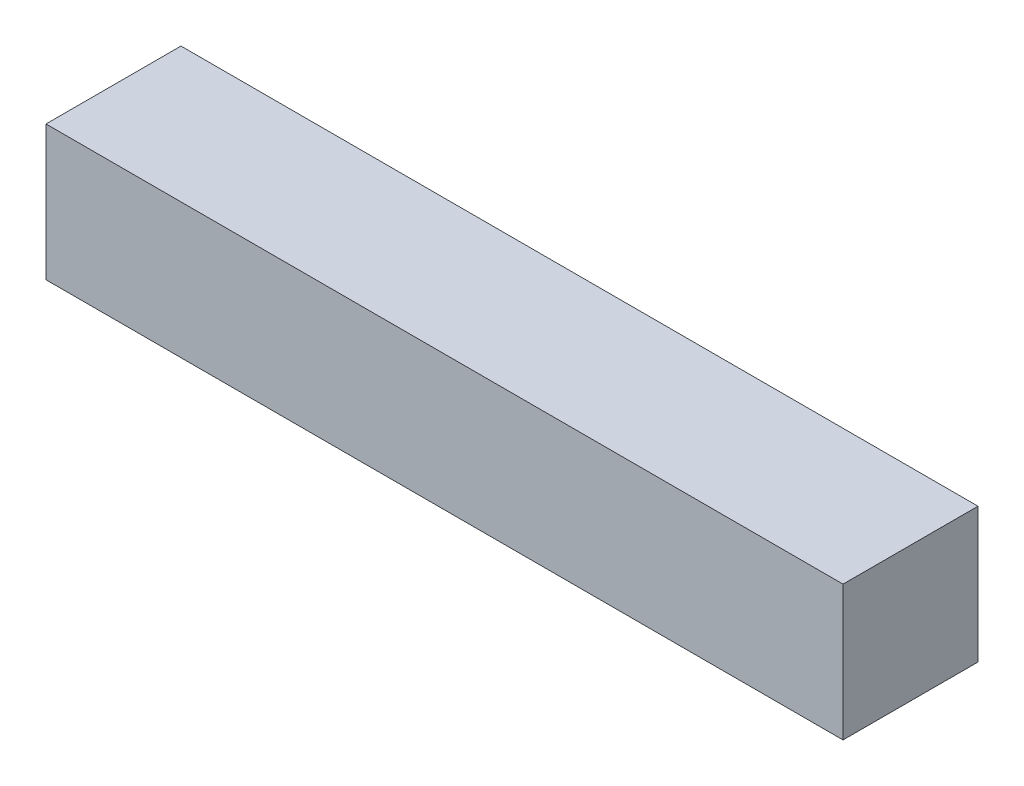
ISO-10303-21;
HEADER;
FILE_DESCRIPTION(('STEP AP214'),'2;1');
FILE_NAME('part.step','',(''),(''),'','','');
FILE_SCHEMA(('AUTOMOTIVE_DESIGN { 1 0 10303 214 1 1 1 1 }'));
ENDSEC;
DATA;
#1=APPLICATION_CONTEXT('core data for automotive mechanical design processes');
#2=APPLICATION_PROTOCOL_DEFINITION('international standard','automotive_design',2000,#1);
#3=PRODUCT_CONTEXT('',#1,'mechanical');
#4=PRODUCT('Part','Part','',(#3));
#5=PRODUCT_RELATED_PRODUCT_CATEGORY('part','',(#4));
#6=PRODUCT_DEFINITION_FORMATION('','',#4);
#7=PRODUCT_DEFINITION_CONTEXT('part definition',#1,'design');
#8=PRODUCT_DEFINITION('design','',#6,#7);
#9=PRODUCT_DEFINITION_SHAPE('','',#8);
#10=(LENGTH_UNIT() NAMED_UNIT(*) SI_UNIT(.MILLI.,.METRE.));
#11=(NAMED_UNIT(*) PLANE_ANGLE_UNIT() SI_UNIT($,.RADIAN.));
#12=(NAMED_UNIT(*) SI_UNIT($,.STERADIAN.) SOLID_ANGLE_UNIT());
#13=UNCERTAINTY_MEASURE_WITH_UNIT(LENGTH_MEASURE(1.E-05),#10,'distance_accuracy_value','');
#14=(GEOMETRIC_REPRESENTATION_CONTEXT(3) GLOBAL_UNCERTAINTY_ASSIGNED_CONTEXT((#13)) GLOBAL_UNIT_ASSIGNED_CONTEXT((#10,
#11,#12)) REPRESENTATION_CONTEXT('',''));
#15=CARTESIAN_POINT('',(0.,0.,0.));
#16=DIRECTION('',(0.,0.,1.));
#17=DIRECTION('',(1.,0.,0.));
#18=AXIS2_PLACEMENT_3D('',#15,#16,#17);
#19=CARTESIAN_POINT('',(75.,-6.35,0.));
#20=DIRECTION('',(0.,1.,0.));
#21=DIRECTION('',(0.,0.,1.));
#22=AXIS2_PLACEMENT_3D('',#19,#20,#21);
#23=PLANE('',#22);
#24=DIRECTION('',(0.,0.,-1.));
#25=VECTOR('',#24,1.);
#26=CARTESIAN_POINT('',(0.,-6.35,0.));
#27=LINE('',#26,#25);
#28=CARTESIAN_POINT('',(0.,-6.35,0.));
#29=VERTEX_POINT('',#28);
#30=CARTESIAN_POINT('',(0.,-6.35,-12.7));
#31=VERTEX_POINT('',#30);
#32=EDGE_CURVE('E115',#29,#31,#27,.T.);
#33=ORIENTED_EDGE('',*,*,#32,.T.);
#34=DIRECTION('',(-1.,0.,0.));
#35=VECTOR('',#34,1.);
#36=CARTESIAN_POINT('',(75.,-6.35,-12.7));
#37=LINE('',#36,#35);
#38=CARTESIAN_POINT('',(75.,-6.35,-12.7));
#39=VERTEX_POINT('',#38);
#40=EDGE_CURVE('E11',#39,#31,#37,.T.);
#41=ORIENTED_EDGE('',*,*,#40,.F.);
#42=DIRECTION('',(0.,0.,-1.));
#43=VECTOR('',#42,1.);
#44=CARTESIAN_POINT('',(75.,-6.35,0.));
#45=LINE('',#44,#43);
#46=CARTESIAN_POINT('',(75.,-6.35,0.));
#47=VERTEX_POINT('',#46);
#48=EDGE_CURVE('E94',#47,#39,#45,.T.);
#49=ORIENTED_EDGE('',*,*,#48,.F.);
#50=DIRECTION('',(-1.,0.,0.));
#51=VECTOR('',#50,1.);
#52=CARTESIAN_POINT('',(75.,-6.35,0.));
#53=LINE('',#52,#51);
#54=EDGE_CURVE('E106',#47,#29,#53,.T.);
#55=ORIENTED_EDGE('',*,*,#54,.T.);
#56=EDGE_LOOP('',(#33,#41,#49,#55));
#57=FACE_BOUND('',#56,.T.);
#58=ADVANCED_FACE('F43',(#57),#23,.F.);
#59=CARTESIAN_POINT('',(75.,-6.35,-12.7));
#60=DIRECTION('',(0.,0.,1.));
#61=DIRECTION('',(1.,0.,0.));
#62=AXIS2_PLACEMENT_3D('',#59,#60,#61);
#63=PLANE('',#62);
#64=DIRECTION('',(0.,1.,0.));
#65=VECTOR('',#64,1.);
#66=CARTESIAN_POINT('',(0.,-6.35,-12.7));
#67=LINE('',#66,#65);
#68=CARTESIAN_POINT('',(0.,6.35,-12.7));
#69=VERTEX_POINT('',#68);
#70=EDGE_CURVE('E99',#31,#69,#67,.T.);
#71=ORIENTED_EDGE('',*,*,#70,.T.);
#72=DIRECTION('',(-1.,0.,0.));
#73=VECTOR('',#72,1.);
#74=CARTESIAN_POINT('',(75.,6.35,-12.7));
#75=LINE('',#74,#73);
#76=CARTESIAN_POINT('',(75.,6.35,-12.7));
#77=VERTEX_POINT('',#76);
#78=EDGE_CURVE('E55',#77,#69,#75,.T.);
#79=ORIENTED_EDGE('',*,*,#78,.F.);
#80=DIRECTION('',(0.,1.,0.));
#81=VECTOR('',#80,1.);
#82=CARTESIAN_POINT('',(75.,-6.35,-12.7));
#83=LINE('',#82,#81);
#84=EDGE_CURVE('E89',#39,#77,#83,.T.);
#85=ORIENTED_EDGE('',*,*,#84,.F.);
#86=ORIENTED_EDGE('',*,*,#40,.T.);
#87=EDGE_LOOP('',(#71,#79,#85,#86));
#88=FACE_BOUND('',#87,.T.);
#89=ADVANCED_FACE('F98',(#88),#63,.F.);
#90=CARTESIAN_POINT('',(75.,6.35,-12.7));
#91=DIRECTION('',(0.,-1.,0.));
#92=DIRECTION('',(0.,0.,-1.));
#93=AXIS2_PLACEMENT_3D('',#90,#91,#92);
#94=PLANE('',#93);
#95=DIRECTION('',(0.,0.,1.));
#96=VECTOR('',#95,1.);
#97=CARTESIAN_POINT('',(0.,6.35,-12.7));
#98=LINE('',#97,#96);
#99=CARTESIAN_POINT('',(0.,6.35,0.));
#100=VERTEX_POINT('',#99);
#101=EDGE_CURVE('E77',#69,#100,#98,.T.);
#102=ORIENTED_EDGE('',*,*,#101,.T.);
#103=DIRECTION('',(-1.,0.,0.));
#104=VECTOR('',#103,1.);
#105=CARTESIAN_POINT('',(75.,6.35,0.));
#106=LINE('',#105,#104);
#107=CARTESIAN_POINT('',(75.,6.35,0.));
#108=VERTEX_POINT('',#107);
#109=EDGE_CURVE('E105',#108,#100,#106,.T.);
#110=ORIENTED_EDGE('',*,*,#109,.F.);
#111=DIRECTION('',(0.,0.,1.));
#112=VECTOR('',#111,1.);
#113=CARTESIAN_POINT('',(75.,6.35,-12.7));
#114=LINE('',#113,#112);
#115=EDGE_CURVE('E93',#77,#108,#114,.T.);
#116=ORIENTED_EDGE('',*,*,#115,.F.);
#117=ORIENTED_EDGE('',*,*,#78,.T.);
#118=EDGE_LOOP('',(#102,#110,#116,#117));
#119=FACE_BOUND('',#118,.T.);
#120=ADVANCED_FACE('F104',(#119),#94,.F.);
#121=CARTESIAN_POINT('',(75.,6.35,0.));
#122=DIRECTION('',(0.,0.,-1.));
#123=DIRECTION('',(-1.,0.,0.));
#124=AXIS2_PLACEMENT_3D('',#121,#122,#123);
#125=PLANE('',#124);
#126=DIRECTION('',(0.,-1.,0.));
#127=VECTOR('',#126,1.);
#128=CARTESIAN_POINT('',(0.,6.35,0.));
#129=LINE('',#128,#127);
#130=EDGE_CURVE('E81',#100,#29,#129,.T.);
#131=ORIENTED_EDGE('',*,*,#130,.T.);
#132=ORIENTED_EDGE('',*,*,#54,.F.);
#133=DIRECTION('',(0.,-1.,0.));
#134=VECTOR('',#133,1.);
#135=CARTESIAN_POINT('',(75.,6.35,0.));
#136=LINE('',#135,#134);
#137=EDGE_CURVE('E58',#108,#47,#136,.T.);
#138=ORIENTED_EDGE('',*,*,#137,.F.);
#139=ORIENTED_EDGE('',*,*,#109,.T.);
#140=EDGE_LOOP('',(#131,#132,#138,#139));
#141=FACE_BOUND('',#140,.T.);
#142=ADVANCED_FACE('F128',(#141),#125,.F.);
#143=CARTESIAN_POINT('',(75.,0.,0.));
#144=DIRECTION('',(1.,0.,0.));
#145=DIRECTION('',(0.,0.,-1.));
#146=AXIS2_PLACEMENT_3D('',#143,#144,#145);
#147=PLANE('',#146);
#148=ORIENTED_EDGE('',*,*,#48,.T.);
#149=ORIENTED_EDGE('',*,*,#84,.T.);
#150=ORIENTED_EDGE('',*,*,#115,.T.);
#151=ORIENTED_EDGE('',*,*,#137,.T.);
#152=EDGE_LOOP('',(#148,#149,#150,#151));
#153=FACE_BOUND('',#152,.T.);
#154=ADVANCED_FACE('F91',(#153),#147,.T.);
#155=CARTESIAN_POINT('',(0.,0.,0.));
#156=DIRECTION('',(1.,0.,0.));
#157=DIRECTION('',(0.,0.,-1.));
#158=AXIS2_PLACEMENT_3D('',#155,#156,#157);
#159=PLANE('',#158);
#160=ORIENTED_EDGE('',*,*,#32,.F.);
#161=ORIENTED_EDGE('',*,*,#130,.F.);
#162=ORIENTED_EDGE('',*,*,#101,.F.);
#163=ORIENTED_EDGE('',*,*,#70,.F.);
#164=EDGE_LOOP('',(#160,#161,#162,#163));
#165=FACE_BOUND('',#164,.T.);
#166=ADVANCED_FACE('F129',(#165),#159,.F.);
#167=CLOSED_SHELL('',(#58,#89,#120,#142,#154,#166));
#168=MANIFOLD_SOLID_BREP('B2',#167);
#169=ADVANCED_BREP_SHAPE_REPRESENTATION('',(#18,#168),#14);
#170=SHAPE_DEFINITION_REPRESENTATION(#9,#169);
ENDSEC;
END-ISO-10303-21;
